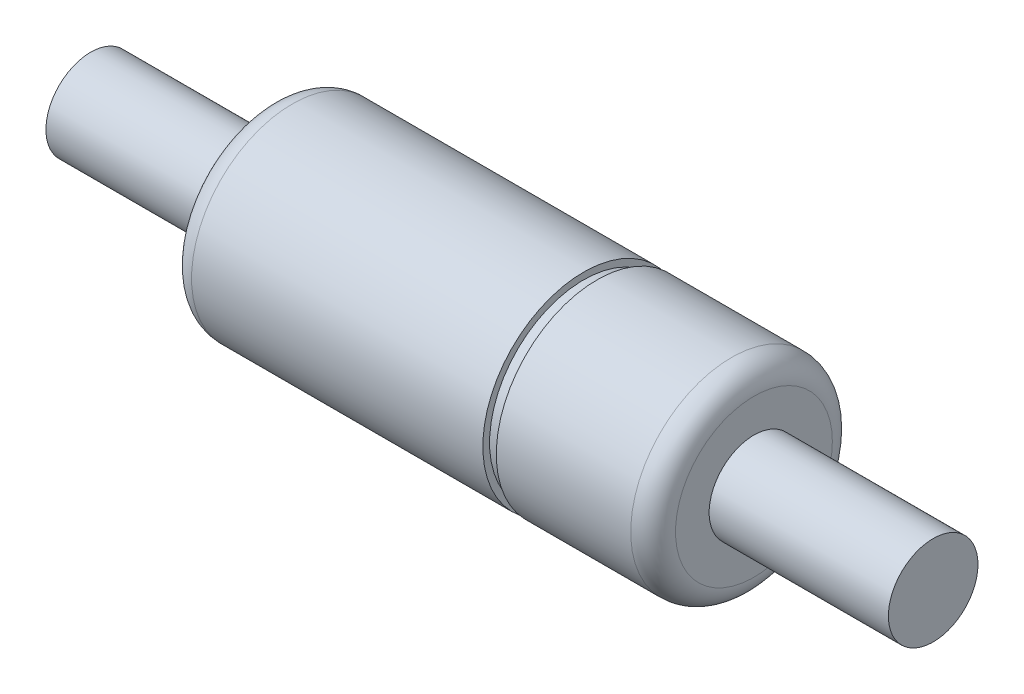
ISO-10303-21;
HEADER;
FILE_DESCRIPTION(('STEP AP214'),'2;1');
FILE_NAME('part.step','',(''),(''),'','','');
FILE_SCHEMA(('AUTOMOTIVE_DESIGN { 1 0 10303 214 1 1 1 1 }'));
ENDSEC;
DATA;
#1=APPLICATION_CONTEXT('core data for automotive mechanical design processes');
#2=APPLICATION_PROTOCOL_DEFINITION('international standard','automotive_design',2000,#1);
#3=PRODUCT_CONTEXT('',#1,'mechanical');
#4=PRODUCT('Part','Part','',(#3));
#5=PRODUCT_RELATED_PRODUCT_CATEGORY('part','',(#4));
#6=PRODUCT_DEFINITION_FORMATION('','',#4);
#7=PRODUCT_DEFINITION_CONTEXT('part definition',#1,'design');
#8=PRODUCT_DEFINITION('design','',#6,#7);
#9=PRODUCT_DEFINITION_SHAPE('','',#8);
#10=(LENGTH_UNIT() NAMED_UNIT(*) SI_UNIT(.MILLI.,.METRE.));
#11=(NAMED_UNIT(*) PLANE_ANGLE_UNIT() SI_UNIT($,.RADIAN.));
#12=(NAMED_UNIT(*) SI_UNIT($,.STERADIAN.) SOLID_ANGLE_UNIT());
#13=UNCERTAINTY_MEASURE_WITH_UNIT(LENGTH_MEASURE(1.E-05),#10,'distance_accuracy_value','');
#14=(GEOMETRIC_REPRESENTATION_CONTEXT(3) GLOBAL_UNCERTAINTY_ASSIGNED_CONTEXT((#13)) GLOBAL_UNIT_ASSIGNED_CONTEXT((#10,
#11,#12)) REPRESENTATION_CONTEXT('',''));
#15=CARTESIAN_POINT('',(0.,0.,0.));
#16=DIRECTION('',(0.,0.,1.));
#17=DIRECTION('',(1.,0.,0.));
#18=AXIS2_PLACEMENT_3D('',#15,#16,#17);
#19=CARTESIAN_POINT('',(-14.8,0.,0.));
#20=DIRECTION('',(1.,0.,0.));
#21=DIRECTION('',(0.,0.,-1.));
#22=AXIS2_PLACEMENT_3D('',#19,#20,#21);
#23=CYLINDRICAL_SURFACE('',#22,1.);
#24=CARTESIAN_POINT('',(-14.8,0.,0.));
#25=DIRECTION('',(1.,0.,0.));
#26=DIRECTION('',(0.,0.,-1.));
#27=AXIS2_PLACEMENT_3D('',#24,#25,#26);
#28=CIRCLE('',#27,1.);
#29=CARTESIAN_POINT('',(-14.8,0.,-1.));
#30=VERTEX_POINT('',#29);
#31=EDGE_CURVE('E10',#30,#30,#28,.T.);
#32=ORIENTED_EDGE('',*,*,#31,.T.);
#33=EDGE_LOOP('',(#32));
#34=FACE_BOUND('',#33,.T.);
#35=CARTESIAN_POINT('',(-10.8,0.,0.));
#36=DIRECTION('',(1.,0.,0.));
#37=DIRECTION('',(0.,0.,-1.));
#38=AXIS2_PLACEMENT_3D('',#35,#36,#37);
#39=CIRCLE('',#38,1.);
#40=CARTESIAN_POINT('',(-10.8,0.,-1.));
#41=VERTEX_POINT('',#40);
#42=EDGE_CURVE('E71',#41,#41,#39,.T.);
#43=ORIENTED_EDGE('',*,*,#42,.F.);
#44=EDGE_LOOP('',(#43));
#45=FACE_BOUND('',#44,.T.);
#46=ADVANCED_FACE('F31',(#34,#45),#23,.T.);
#47=CARTESIAN_POINT('',(-14.8,1.,0.));
#48=DIRECTION('',(-1.,0.,0.));
#49=DIRECTION('',(0.,0.,1.));
#50=AXIS2_PLACEMENT_3D('',#47,#48,#49);
#51=PLANE('',#50);
#52=ORIENTED_EDGE('',*,*,#31,.F.);
#53=EDGE_LOOP('',(#52));
#54=FACE_BOUND('',#53,.T.);
#55=ADVANCED_FACE('F79',(#54),#51,.T.);
#56=CARTESIAN_POINT('',(4.,0.,0.));
#57=DIRECTION('',(1.,0.,0.));
#58=DIRECTION('',(0.,0.,-1.));
#59=AXIS2_PLACEMENT_3D('',#56,#57,#58);
#60=PLANE('',#59);
#61=CARTESIAN_POINT('',(4.,0.,0.));
#62=DIRECTION('',(1.,0.,0.));
#63=DIRECTION('',(0.,0.,-1.));
#64=AXIS2_PLACEMENT_3D('',#61,#62,#63);
#65=CIRCLE('',#64,1.);
#66=CARTESIAN_POINT('',(4.,0.,-1.));
#67=VERTEX_POINT('',#66);
#68=EDGE_CURVE('E37',#67,#67,#65,.T.);
#69=ORIENTED_EDGE('',*,*,#68,.T.);
#70=EDGE_LOOP('',(#69));
#71=FACE_BOUND('',#70,.T.);
#72=ADVANCED_FACE('F83',(#71),#60,.T.);
#73=CARTESIAN_POINT('',(-14.8,0.,0.));
#74=DIRECTION('',(1.,0.,0.));
#75=DIRECTION('',(0.,0.,-1.));
#76=AXIS2_PLACEMENT_3D('',#73,#74,#75);
#77=CYLINDRICAL_SURFACE('',#76,1.);
#78=CARTESIAN_POINT('',(0.,0.,0.));
#79=DIRECTION('',(1.,0.,0.));
#80=DIRECTION('',(0.,0.,-1.));
#81=AXIS2_PLACEMENT_3D('',#78,#79,#80);
#82=CIRCLE('',#81,1.);
#83=CARTESIAN_POINT('',(0.,0.,-1.));
#84=VERTEX_POINT('',#83);
#85=EDGE_CURVE('E41',#84,#84,#82,.T.);
#86=ORIENTED_EDGE('',*,*,#85,.T.);
#87=EDGE_LOOP('',(#86));
#88=FACE_BOUND('',#87,.T.);
#89=ORIENTED_EDGE('',*,*,#68,.F.);
#90=EDGE_LOOP('',(#89));
#91=FACE_BOUND('',#90,.T.);
#92=ADVANCED_FACE('F88',(#88,#91),#77,.T.);
#93=CARTESIAN_POINT('',(0.,1.,0.));
#94=DIRECTION('',(1.,0.,0.));
#95=DIRECTION('',(0.,0.,-1.));
#96=AXIS2_PLACEMENT_3D('',#93,#94,#95);
#97=PLANE('',#96);
#98=CARTESIAN_POINT('',(0.,0.,0.));
#99=DIRECTION('',(1.,0.,0.));
#100=DIRECTION('',(0.,0.,-1.));
#101=AXIS2_PLACEMENT_3D('',#98,#99,#100);
#102=CIRCLE('',#101,1.75);
#103=CARTESIAN_POINT('',(0.,0.,-1.75));
#104=VERTEX_POINT('',#103);
#105=EDGE_CURVE('E45',#104,#104,#102,.T.);
#106=ORIENTED_EDGE('',*,*,#105,.T.);
#107=EDGE_LOOP('',(#106));
#108=FACE_BOUND('',#107,.T.);
#109=ORIENTED_EDGE('',*,*,#85,.F.);
#110=EDGE_LOOP('',(#109));
#111=FACE_BOUND('',#110,.T.);
#112=ADVANCED_FACE('F93',(#108,#111),#97,.T.);
#113=CARTESIAN_POINT('',(-0.5,0.,0.));
#114=DIRECTION('',(1.,0.,0.));
#115=DIRECTION('',(0.,0.,-1.));
#116=AXIS2_PLACEMENT_3D('',#113,#114,#115);
#117=TOROIDAL_SURFACE('',#116,1.75,0.5);
#118=CARTESIAN_POINT('',(-0.5,0.,0.));
#119=DIRECTION('',(1.,0.,0.));
#120=DIRECTION('',(0.,0.,-1.));
#121=AXIS2_PLACEMENT_3D('',#118,#119,#120);
#122=CIRCLE('',#121,2.25);
#123=CARTESIAN_POINT('',(-0.5,0.,-2.25));
#124=VERTEX_POINT('',#123);
#125=EDGE_CURVE('E50',#124,#124,#122,.T.);
#126=ORIENTED_EDGE('',*,*,#125,.T.);
#127=EDGE_LOOP('',(#126));
#128=FACE_BOUND('',#127,.T.);
#129=ORIENTED_EDGE('',*,*,#105,.F.);
#130=EDGE_LOOP('',(#129));
#131=FACE_BOUND('',#130,.T.);
#132=ADVANCED_FACE('F97',(#128,#131),#117,.T.);
#133=CARTESIAN_POINT('',(-14.8,0.,0.));
#134=DIRECTION('',(1.,0.,0.));
#135=DIRECTION('',(0.,0.,-1.));
#136=AXIS2_PLACEMENT_3D('',#133,#134,#135);
#137=CYLINDRICAL_SURFACE('',#136,2.25);
#138=CARTESIAN_POINT('',(-3.5,0.,0.));
#139=DIRECTION('',(1.,0.,0.));
#140=DIRECTION('',(0.,0.,-1.));
#141=AXIS2_PLACEMENT_3D('',#138,#139,#140);
#142=CIRCLE('',#141,2.25);
#143=CARTESIAN_POINT('',(-3.5,0.,-2.25));
#144=VERTEX_POINT('',#143);
#145=EDGE_CURVE('E53',#144,#144,#142,.T.);
#146=ORIENTED_EDGE('',*,*,#145,.T.);
#147=EDGE_LOOP('',(#146));
#148=FACE_BOUND('',#147,.T.);
#149=ORIENTED_EDGE('',*,*,#125,.F.);
#150=EDGE_LOOP('',(#149));
#151=FACE_BOUND('',#150,.T.);
#152=ADVANCED_FACE('F101',(#148,#151),#137,.T.);
#153=CARTESIAN_POINT('',(-3.5,2.25,0.));
#154=DIRECTION('',(-1.,0.,0.));
#155=DIRECTION('',(0.,0.,1.));
#156=AXIS2_PLACEMENT_3D('',#153,#154,#155);
#157=PLANE('',#156);
#158=CARTESIAN_POINT('',(-3.5,0.,0.));
#159=DIRECTION('',(1.,0.,0.));
#160=DIRECTION('',(0.,0.,-1.));
#161=AXIS2_PLACEMENT_3D('',#158,#159,#160);
#162=CIRCLE('',#161,2.1);
#163=CARTESIAN_POINT('',(-3.5,0.,-2.1));
#164=VERTEX_POINT('',#163);
#165=EDGE_CURVE('E56',#164,#164,#162,.T.);
#166=ORIENTED_EDGE('',*,*,#165,.T.);
#167=EDGE_LOOP('',(#166));
#168=FACE_BOUND('',#167,.T.);
#169=ORIENTED_EDGE('',*,*,#145,.F.);
#170=EDGE_LOOP('',(#169));
#171=FACE_BOUND('',#170,.T.);
#172=ADVANCED_FACE('F105',(#168,#171),#157,.T.);
#173=CARTESIAN_POINT('',(-14.8,0.,0.));
#174=DIRECTION('',(1.,0.,0.));
#175=DIRECTION('',(0.,0.,-1.));
#176=AXIS2_PLACEMENT_3D('',#173,#174,#175);
#177=CYLINDRICAL_SURFACE('',#176,2.1);
#178=CARTESIAN_POINT('',(-3.8,0.,0.));
#179=DIRECTION('',(1.,0.,0.));
#180=DIRECTION('',(0.,0.,-1.));
#181=AXIS2_PLACEMENT_3D('',#178,#179,#180);
#182=CIRCLE('',#181,2.1);
#183=CARTESIAN_POINT('',(-3.8,0.,-2.1));
#184=VERTEX_POINT('',#183);
#185=EDGE_CURVE('E59',#184,#184,#182,.T.);
#186=ORIENTED_EDGE('',*,*,#185,.T.);
#187=EDGE_LOOP('',(#186));
#188=FACE_BOUND('',#187,.T.);
#189=ORIENTED_EDGE('',*,*,#165,.F.);
#190=EDGE_LOOP('',(#189));
#191=FACE_BOUND('',#190,.T.);
#192=ADVANCED_FACE('F109',(#188,#191),#177,.T.);
#193=CARTESIAN_POINT('',(-3.8,2.1,0.));
#194=DIRECTION('',(1.,0.,0.));
#195=DIRECTION('',(0.,0.,-1.));
#196=AXIS2_PLACEMENT_3D('',#193,#194,#195);
#197=PLANE('',#196);
#198=CARTESIAN_POINT('',(-3.8,0.,0.));
#199=DIRECTION('',(1.,0.,0.));
#200=DIRECTION('',(0.,0.,-1.));
#201=AXIS2_PLACEMENT_3D('',#198,#199,#200);
#202=CIRCLE('',#201,2.25);
#203=CARTESIAN_POINT('',(-3.8,0.,-2.25));
#204=VERTEX_POINT('',#203);
#205=EDGE_CURVE('E62',#204,#204,#202,.T.);
#206=ORIENTED_EDGE('',*,*,#205,.T.);
#207=EDGE_LOOP('',(#206));
#208=FACE_BOUND('',#207,.T.);
#209=ORIENTED_EDGE('',*,*,#185,.F.);
#210=EDGE_LOOP('',(#209));
#211=FACE_BOUND('',#210,.T.);
#212=ADVANCED_FACE('F113',(#208,#211),#197,.T.);
#213=CARTESIAN_POINT('',(-14.8,0.,0.));
#214=DIRECTION('',(1.,0.,0.));
#215=DIRECTION('',(0.,0.,-1.));
#216=AXIS2_PLACEMENT_3D('',#213,#214,#215);
#217=CYLINDRICAL_SURFACE('',#216,2.25);
#218=CARTESIAN_POINT('',(-10.3,0.,0.));
#219=DIRECTION('',(1.,0.,0.));
#220=DIRECTION('',(0.,0.,-1.));
#221=AXIS2_PLACEMENT_3D('',#218,#219,#220);
#222=CIRCLE('',#221,2.25);
#223=CARTESIAN_POINT('',(-10.3,0.,-2.25));
#224=VERTEX_POINT('',#223);
#225=EDGE_CURVE('E65',#224,#224,#222,.T.);
#226=ORIENTED_EDGE('',*,*,#225,.T.);
#227=EDGE_LOOP('',(#226));
#228=FACE_BOUND('',#227,.T.);
#229=ORIENTED_EDGE('',*,*,#205,.F.);
#230=EDGE_LOOP('',(#229));
#231=FACE_BOUND('',#230,.T.);
#232=ADVANCED_FACE('F117',(#228,#231),#217,.T.);
#233=CARTESIAN_POINT('',(-10.3,0.,0.));
#234=DIRECTION('',(1.,0.,0.));
#235=DIRECTION('',(0.,0.,-1.));
#236=AXIS2_PLACEMENT_3D('',#233,#234,#235);
#237=TOROIDAL_SURFACE('',#236,1.75,0.5);
#238=CARTESIAN_POINT('',(-10.8,0.,0.));
#239=DIRECTION('',(1.,0.,0.));
#240=DIRECTION('',(0.,0.,-1.));
#241=AXIS2_PLACEMENT_3D('',#238,#239,#240);
#242=CIRCLE('',#241,1.75);
#243=CARTESIAN_POINT('',(-10.8,0.,-1.75));
#244=VERTEX_POINT('',#243);
#245=EDGE_CURVE('E68',#244,#244,#242,.T.);
#246=ORIENTED_EDGE('',*,*,#245,.T.);
#247=EDGE_LOOP('',(#246));
#248=FACE_BOUND('',#247,.T.);
#249=ORIENTED_EDGE('',*,*,#225,.F.);
#250=EDGE_LOOP('',(#249));
#251=FACE_BOUND('',#250,.T.);
#252=ADVANCED_FACE('F121',(#248,#251),#237,.T.);
#253=CARTESIAN_POINT('',(-10.8,1.75,0.));
#254=DIRECTION('',(-1.,0.,0.));
#255=DIRECTION('',(0.,0.,1.));
#256=AXIS2_PLACEMENT_3D('',#253,#254,#255);
#257=PLANE('',#256);
#258=ORIENTED_EDGE('',*,*,#42,.T.);
#259=EDGE_LOOP('',(#258));
#260=FACE_BOUND('',#259,.T.);
#261=ORIENTED_EDGE('',*,*,#245,.F.);
#262=EDGE_LOOP('',(#261));
#263=FACE_BOUND('',#262,.T.);
#264=ADVANCED_FACE('F75',(#260,#263),#257,.T.);
#265=CLOSED_SHELL('',(#46,#55,#72,#92,#112,#132,#152,#172,#192,#212,#232,#252,#264));
#266=MANIFOLD_SOLID_BREP('B2',#265);
#267=ADVANCED_BREP_SHAPE_REPRESENTATION('',(#18,#266),#14);
#268=SHAPE_DEFINITION_REPRESENTATION(#9,#267);
ENDSEC;
END-ISO-10303-21;
